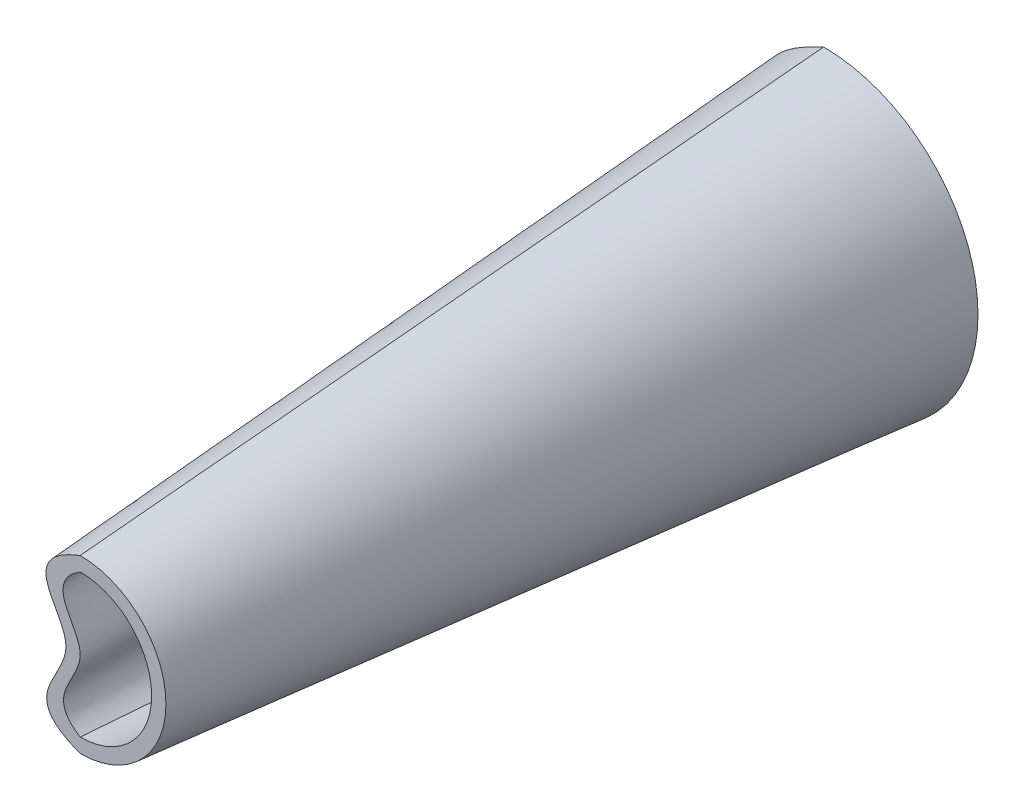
ISO-10303-21;
HEADER;
FILE_DESCRIPTION(('STEP AP214'),'2;1');
FILE_NAME('part.step','',(''),(''),'','','');
FILE_SCHEMA(('AUTOMOTIVE_DESIGN { 1 0 10303 214 1 1 1 1 }'));
ENDSEC;
DATA;
#1=APPLICATION_CONTEXT('core data for automotive mechanical design processes');
#2=APPLICATION_PROTOCOL_DEFINITION('international standard','automotive_design',2000,#1);
#3=PRODUCT_CONTEXT('',#1,'mechanical');
#4=PRODUCT('Part','Part','',(#3));
#5=PRODUCT_RELATED_PRODUCT_CATEGORY('part','',(#4));
#6=PRODUCT_DEFINITION_FORMATION('','',#4);
#7=PRODUCT_DEFINITION_CONTEXT('part definition',#1,'design');
#8=PRODUCT_DEFINITION('design','',#6,#7);
#9=PRODUCT_DEFINITION_SHAPE('','',#8);
#10=(LENGTH_UNIT() NAMED_UNIT(*) SI_UNIT(.MILLI.,.METRE.));
#11=(NAMED_UNIT(*) PLANE_ANGLE_UNIT() SI_UNIT($,.RADIAN.));
#12=(NAMED_UNIT(*) SI_UNIT($,.STERADIAN.) SOLID_ANGLE_UNIT());
#13=UNCERTAINTY_MEASURE_WITH_UNIT(LENGTH_MEASURE(1.E-05),#10,'distance_accuracy_value','');
#14=(GEOMETRIC_REPRESENTATION_CONTEXT(3) GLOBAL_UNCERTAINTY_ASSIGNED_CONTEXT((#13)) GLOBAL_UNIT_ASSIGNED_CONTEXT((#10,
#11,#12)) REPRESENTATION_CONTEXT('',''));
#15=CARTESIAN_POINT('',(0.,0.,0.));
#16=DIRECTION('',(0.,0.,1.));
#17=DIRECTION('',(1.,0.,0.));
#18=AXIS2_PLACEMENT_3D('',#15,#16,#17);
#19=CARTESIAN_POINT('',(0.,0.,-330.2));
#20=DIRECTION('',(0.,0.,-1.));
#21=DIRECTION('',(-1.,0.,0.));
#22=AXIS2_PLACEMENT_3D('',#19,#20,#21);
#23=PLANE('',#22);
#24=CARTESIAN_POINT('',(0.,0.,-330.2));
#25=DIRECTION('',(0.,0.,-1.));
#26=DIRECTION('',(-1.,0.,0.));
#27=AXIS2_PLACEMENT_3D('',#24,#25,#26);
#28=CIRCLE('',#27,68.58);
#29=CARTESIAN_POINT('',(0.,68.58,-330.2));
#30=VERTEX_POINT('',#29);
#31=CARTESIAN_POINT('',(0.,-68.58,-330.2));
#32=VERTEX_POINT('',#31);
#33=EDGE_CURVE('E82',#30,#32,#28,.T.);
#34=ORIENTED_EDGE('',*,*,#33,.T.);
#35=CARTESIAN_POINT('',(0.,68.58,-330.2));
#36=CARTESIAN_POINT('',(-55.0566331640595,43.7725433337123,-330.2));
#37=CARTESIAN_POINT('',(41.7327268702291,0.365303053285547,-330.2));
#38=CARTESIAN_POINT('',(-53.8093488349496,-44.4651473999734,-330.2));
#39=CARTESIAN_POINT('',(0.,-68.58,-330.2));
#40=B_SPLINE_CURVE_WITH_KNOTS('',3,(#35,#36,#37,#38,#39),.UNSPECIFIED.,.F.,.F.,(4,1,4),(0.,
0.500107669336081,1.),.UNSPECIFIED.);
#41=EDGE_CURVE('E12',#30,#32,#40,.T.);
#42=ORIENTED_EDGE('',*,*,#41,.F.);
#43=EDGE_LOOP('',(#34,#42));
#44=FACE_BOUND('',#43,.T.);
#45=CARTESIAN_POINT('',(0.,57.15,-330.2));
#46=CARTESIAN_POINT('',(-35.1734171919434,36.096405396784,-330.2));
#47=CARTESIAN_POINT('',(34.660452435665,0.264321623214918,-330.2));
#48=CARTESIAN_POINT('',(-34.1482146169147,-36.5722233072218,-330.2));
#49=CARTESIAN_POINT('',(0.,-57.15,-330.2));
#50=B_SPLINE_CURVE_WITH_KNOTS('',3,(#45,#46,#47,#48,#49),.UNSPECIFIED.,.F.,.F.,(4,1,4),(0.,
0.500181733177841,1.),.UNSPECIFIED.);
#51=CARTESIAN_POINT('',(0.,57.15,-330.2));
#52=VERTEX_POINT('',#51);
#53=CARTESIAN_POINT('',(0.,-57.15,-330.2));
#54=VERTEX_POINT('',#53);
#55=EDGE_CURVE('E118',#52,#54,#50,.T.);
#56=ORIENTED_EDGE('',*,*,#55,.T.);
#57=CARTESIAN_POINT('',(0.,0.,-330.2));
#58=DIRECTION('',(0.,0.,-1.));
#59=DIRECTION('',(-1.,0.,0.));
#60=AXIS2_PLACEMENT_3D('',#57,#58,#59);
#61=CIRCLE('',#60,57.15);
#62=EDGE_CURVE('E120',#52,#54,#61,.T.);
#63=ORIENTED_EDGE('',*,*,#62,.F.);
#64=EDGE_LOOP('',(#56,#63));
#65=FACE_BOUND('',#64,.T.);
#66=ADVANCED_FACE('F71',(#44,#65),#23,.T.);
#67=CARTESIAN_POINT('',(0.,0.,0.));
#68=DIRECTION('',(0.,0.,-1.));
#69=DIRECTION('',(-1.,0.,0.));
#70=AXIS2_PLACEMENT_3D('',#67,#68,#69);
#71=PLANE('',#70);
#72=CARTESIAN_POINT('',(0.,0.,0.));
#73=DIRECTION('',(0.,0.,-1.));
#74=DIRECTION('',(-1.,0.,0.));
#75=AXIS2_PLACEMENT_3D('',#72,#73,#74);
#76=CIRCLE('',#75,38.1);
#77=CARTESIAN_POINT('',(0.,38.1,0.));
#78=VERTEX_POINT('',#77);
#79=CARTESIAN_POINT('',(0.,-38.1,0.));
#80=VERTEX_POINT('',#79);
#81=EDGE_CURVE('E141',#78,#80,#76,.T.);
#82=ORIENTED_EDGE('',*,*,#81,.F.);
#83=CARTESIAN_POINT('',(0.,38.1,0.));
#84=CARTESIAN_POINT('',(-17.8927828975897,31.1690066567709,0.));
#85=CARTESIAN_POINT('',(-15.8512028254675,18.6410538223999,0.));
#86=CARTESIAN_POINT('',(3.04103633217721,-7.95070814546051,0.));
#87=CARTESIAN_POINT('',(-29.2953875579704,-26.9520101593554,0.));
#88=CARTESIAN_POINT('',(0.,-38.1,0.));
#89=B_SPLINE_CURVE_WITH_KNOTS('',3,(#83,#84,#85,#86,#87,#88),.UNSPECIFIED.,.F.,.F.,(4,1,1,4),
(0.,0.299573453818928,0.499714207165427,1.),.UNSPECIFIED.);
#90=EDGE_CURVE('E144',#78,#80,#89,.T.);
#91=ORIENTED_EDGE('',*,*,#90,.T.);
#92=EDGE_LOOP('',(#82,#91));
#93=FACE_BOUND('',#92,.T.);
#94=CARTESIAN_POINT('',(0.,0.,0.));
#95=DIRECTION('',(0.,0.,-1.));
#96=DIRECTION('',(-1.,0.,0.));
#97=AXIS2_PLACEMENT_3D('',#94,#95,#96);
#98=CIRCLE('',#97,31.75);
#99=CARTESIAN_POINT('',(0.,31.75,0.));
#100=VERTEX_POINT('',#99);
#101=CARTESIAN_POINT('',(0.,-31.75,0.));
#102=VERTEX_POINT('',#101);
#103=EDGE_CURVE('E122',#100,#102,#98,.T.);
#104=ORIENTED_EDGE('',*,*,#103,.T.);
#105=CARTESIAN_POINT('',(0.,31.75,0.));
#106=CARTESIAN_POINT('',(-17.0549944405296,21.1222624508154,0.));
#107=CARTESIAN_POINT('',(16.8428680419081,0.131844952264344,0.));
#108=CARTESIAN_POINT('',(-16.6306860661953,-21.3914922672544,0.));
#109=CARTESIAN_POINT('',(0.,-31.75,0.));
#110=B_SPLINE_CURVE_WITH_KNOTS('',3,(#105,#106,#107,#108,#109),.UNSPECIFIED.,.F.,.F.,(4,1,4),
(0.,0.499967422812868,1.),.UNSPECIFIED.);
#111=EDGE_CURVE('E115',#100,#102,#110,.T.);
#112=ORIENTED_EDGE('',*,*,#111,.F.);
#113=EDGE_LOOP('',(#104,#112));
#114=FACE_BOUND('',#113,.T.);
#115=ADVANCED_FACE('F126',(#93,#114),#71,.F.);
#116=CARTESIAN_POINT('',(0.,-38.1,0.));
#117=CARTESIAN_POINT('',(0.,-68.58,-330.2));
#118=CARTESIAN_POINT('',(-29.2723474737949,-26.9607777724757,0.));
#119=CARTESIAN_POINT('',(-53.8093488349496,-44.4651473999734,-330.2));
#120=CARTESIAN_POINT('',(-6.21697856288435,-13.3908377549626,0.));
#121=CARTESIAN_POINT('',(-6.01100574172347,-22.0371099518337,-330.2));
#122=CARTESIAN_POINT('',(-6.40304913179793,5.3423097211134,0.));
#123=CARTESIAN_POINT('',(-6.48632157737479,8.86461563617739,-330.2));
#124=CARTESIAN_POINT('',(-15.8512028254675,18.6410538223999,0.));
#125=CARTESIAN_POINT('',(-26.0665536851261,30.7869432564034,-330.2));
#126=CARTESIAN_POINT('',(-17.8927828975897,31.1690066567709,0.));
#127=CARTESIAN_POINT('',(-32.9799096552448,53.7198890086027,-330.2));
#128=CARTESIAN_POINT('',(0.,38.1,0.));
#129=CARTESIAN_POINT('',(0.,68.58,-330.2));
#130=B_SPLINE_SURFACE_WITH_KNOTS('',3,1,((#116,#117),(#118,#119),(#120,#121),(#122,#123),(#124,
#125),(#126,#127),(#128,#129)),.UNSPECIFIED.,.F.,.F.,.F.,(4,1,1,1,4),(2,2),(0.,
0.499892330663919,0.500285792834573,0.700426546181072,1.),(0.,1.),.UNSPECIFIED.);
#131=DIRECTION('',(0.,0.0919169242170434,-0.995766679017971));
#132=VECTOR('',#131,1.);
#133=CARTESIAN_POINT('',(0.,53.34,-165.1));
#134=LINE('',#133,#132);
#135=EDGE_CURVE('E193',#78,#30,#134,.T.);
#136=DIRECTION('',(0.,0.0919169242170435,0.995766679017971));
#137=VECTOR('',#136,1.);
#138=CARTESIAN_POINT('',(0.,-53.34,-165.1));
#139=LINE('',#138,#137);
#140=EDGE_CURVE('E150',#32,#80,#139,.T.);
#141=ORIENTED_EDGE('',*,*,#90,.F.);
#142=ORIENTED_EDGE('',*,*,#135,.T.);
#143=ORIENTED_EDGE('',*,*,#41,.T.);
#144=ORIENTED_EDGE('',*,*,#140,.T.);
#145=EDGE_LOOP('',(#141,#142,#143,#144));
#146=FACE_BOUND('',#145,.T.);
#147=ADVANCED_FACE('F176',(#146),#130,.T.);
#148=CARTESIAN_POINT('',(0.,0.,0.));
#149=DIRECTION('',(0.,0.,-1.));
#150=DIRECTION('',(-1.,0.,0.));
#151=AXIS2_PLACEMENT_3D('',#148,#149,#150);
#152=CONICAL_SURFACE('',#151,38.1,0.0920468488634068);
#153=ORIENTED_EDGE('',*,*,#140,.F.);
#154=ORIENTED_EDGE('',*,*,#33,.F.);
#155=ORIENTED_EDGE('',*,*,#135,.F.);
#156=ORIENTED_EDGE('',*,*,#81,.T.);
#157=EDGE_LOOP('',(#153,#154,#155,#156));
#158=FACE_BOUND('',#157,.T.);
#159=ADVANCED_FACE('F219',(#158),#152,.T.);
#160=CARTESIAN_POINT('',(0.,-31.75,0.));
#161=CARTESIAN_POINT('',(0.,-57.15,-330.2));
#162=CARTESIAN_POINT('',(-16.623558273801,-21.3959318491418,0.));
#163=CARTESIAN_POINT('',(-34.1482146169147,-36.5722233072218,-330.2));
#164=CARTESIAN_POINT('',(0.100007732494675,-10.6337351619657,0.));
#165=CARTESIAN_POINT('',(0.258360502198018,-18.1527508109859,-330.2));
#166=CARTESIAN_POINT('',(-0.0999028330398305,10.6232390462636,0.));
#167=CARTESIAN_POINT('',(-0.258757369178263,18.1815308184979,-330.2));
#168=CARTESIAN_POINT('',(-17.0549944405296,21.1222624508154,0.));
#169=CARTESIAN_POINT('',(-35.15834661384,36.1054261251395,-330.2));
#170=CARTESIAN_POINT('',(0.,31.75,0.));
#171=CARTESIAN_POINT('',(0.,57.15,-330.2));
#172=B_SPLINE_SURFACE_WITH_KNOTS('',3,1,((#160,#161),(#162,#163),(#164,#165),(#166,#167),(#168,
#169),(#170,#171)),.UNSPECIFIED.,.F.,.F.,.F.,(4,1,1,4),(2,2),(0.,0.499818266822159,
0.500032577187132,1.),(0.,1.),.UNSPECIFIED.);
#173=DIRECTION('',(0.,0.0766964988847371,0.997054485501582));
#174=VECTOR('',#173,1.);
#175=CARTESIAN_POINT('',(0.,-44.45,-165.1));
#176=LINE('',#175,#174);
#177=EDGE_CURVE('E95',#54,#102,#176,.T.);
#178=DIRECTION('',(0.,0.076696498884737,-0.997054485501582));
#179=VECTOR('',#178,1.);
#180=CARTESIAN_POINT('',(0.,44.45,-165.1));
#181=LINE('',#180,#179);
#182=EDGE_CURVE('E90',#100,#52,#181,.T.);
#183=ORIENTED_EDGE('',*,*,#111,.T.);
#184=ORIENTED_EDGE('',*,*,#177,.F.);
#185=ORIENTED_EDGE('',*,*,#55,.F.);
#186=ORIENTED_EDGE('',*,*,#182,.F.);
#187=EDGE_LOOP('',(#183,#184,#185,#186));
#188=FACE_BOUND('',#187,.T.);
#189=ADVANCED_FACE('F113',(#188),#172,.F.);
#190=CARTESIAN_POINT('',(0.,0.,0.));
#191=DIRECTION('',(0.,0.,-1.));
#192=DIRECTION('',(-1.,0.,0.));
#193=AXIS2_PLACEMENT_3D('',#190,#191,#192);
#194=CONICAL_SURFACE('',#193,31.75,0.076771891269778);
#195=ORIENTED_EDGE('',*,*,#177,.T.);
#196=ORIENTED_EDGE('',*,*,#103,.F.);
#197=ORIENTED_EDGE('',*,*,#182,.T.);
#198=ORIENTED_EDGE('',*,*,#62,.T.);
#199=EDGE_LOOP('',(#195,#196,#197,#198));
#200=FACE_BOUND('',#199,.T.);
#201=ADVANCED_FACE('F123',(#200),#194,.F.);
#202=CLOSED_SHELL('',(#66,#115,#147,#159,#189,#201));
#203=MANIFOLD_SOLID_BREP('B2',#202);
#204=ADVANCED_BREP_SHAPE_REPRESENTATION('',(#18,#203),#14);
#205=SHAPE_DEFINITION_REPRESENTATION(#9,#204);
ENDSEC;
END-ISO-10303-21;
